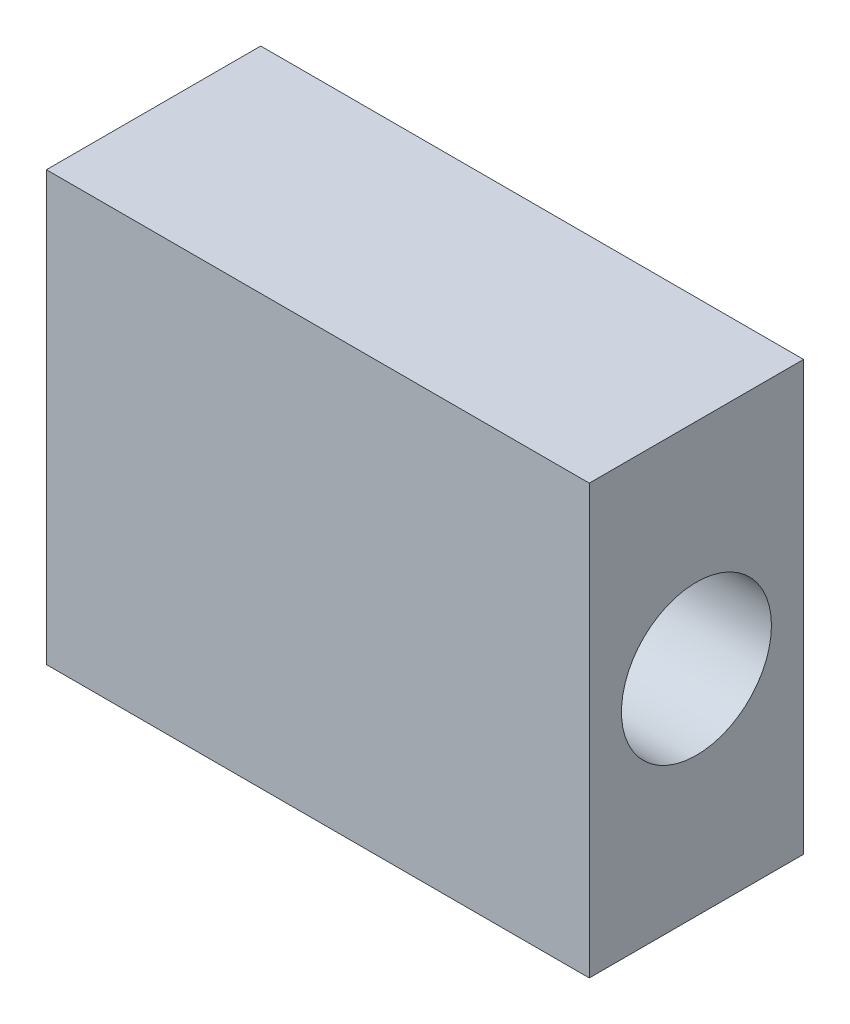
from build123d import *

# Parameters (mm, degrees)
ESQUISSE1_W                = 38
ESQUISSE1_H                = 30
EXTRUSION1_DEPTH           = 15
TROU_TARAUD_M12X1_51_D     = 10.5
TROU_TARAUD_M12X1_51_DEPTH = 26.5
TROU_TARAUD_M12X1_51_TIP   = 3.15451825


with BuildPart() as part:
    # Esquisse1 → Extrusion1 (new body)
    with BuildSketch(Plane.XY):
        with Locations((19, 15)):
            Rectangle(ESQUISSE1_W, ESQUISSE1_H)
    extrude(amount=EXTRUSION1_DEPTH)

    # Trou taraud_ M12x1.51
    with Locations(Plane(origin=(38, 0, 0), x_dir=(0, 0, -1), z_dir=(1, 0, 0))):
        with Locations((-7.5, 15)):
            Hole(TROU_TARAUD_M12X1_51_D / 2, depth=TROU_TARAUD_M12X1_51_DEPTH)
            with Locations((0, 0, -(TROU_TARAUD_M12X1_51_DEPTH + TROU_TARAUD_M12X1_51_TIP / 2))):  # 118° drill point
                Cone(0, TROU_TARAUD_M12X1_51_D / 2, TROU_TARAUD_M12X1_51_TIP, mode=Mode.SUBTRACT)


solid = part.part
